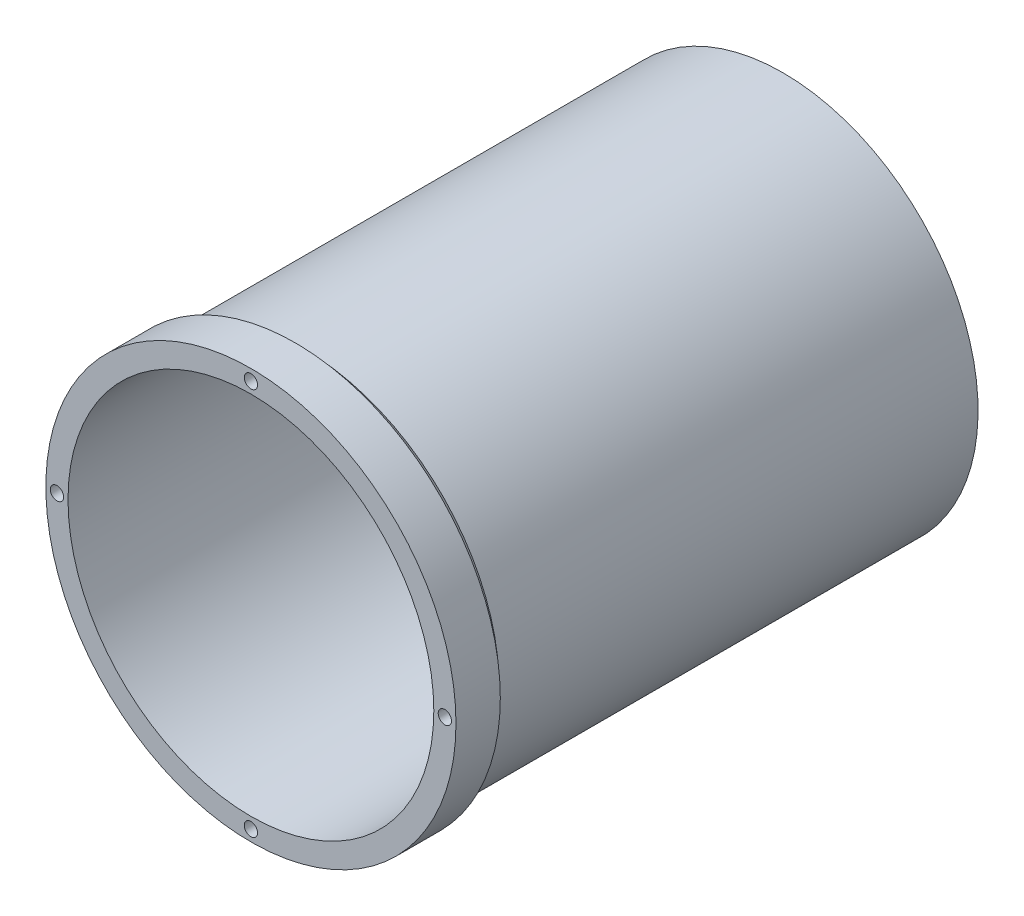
ISO-10303-21;
HEADER;
FILE_DESCRIPTION(('STEP AP214'),'2;1');
FILE_NAME('part.step','',(''),(''),'','','');
FILE_SCHEMA(('AUTOMOTIVE_DESIGN { 1 0 10303 214 1 1 1 1 }'));
ENDSEC;
DATA;
#1=APPLICATION_CONTEXT('core data for automotive mechanical design processes');
#2=APPLICATION_PROTOCOL_DEFINITION('international standard','automotive_design',2000,#1);
#3=PRODUCT_CONTEXT('',#1,'mechanical');
#4=PRODUCT('Part','Part','',(#3));
#5=PRODUCT_RELATED_PRODUCT_CATEGORY('part','',(#4));
#6=PRODUCT_DEFINITION_FORMATION('','',#4);
#7=PRODUCT_DEFINITION_CONTEXT('part definition',#1,'design');
#8=PRODUCT_DEFINITION('design','',#6,#7);
#9=PRODUCT_DEFINITION_SHAPE('','',#8);
#10=(LENGTH_UNIT() NAMED_UNIT(*) SI_UNIT(.MILLI.,.METRE.));
#11=(NAMED_UNIT(*) PLANE_ANGLE_UNIT() SI_UNIT($,.RADIAN.));
#12=(NAMED_UNIT(*) SI_UNIT($,.STERADIAN.) SOLID_ANGLE_UNIT());
#13=UNCERTAINTY_MEASURE_WITH_UNIT(LENGTH_MEASURE(1.E-05),#10,'distance_accuracy_value','');
#14=(GEOMETRIC_REPRESENTATION_CONTEXT(3) GLOBAL_UNCERTAINTY_ASSIGNED_CONTEXT((#13)) GLOBAL_UNIT_ASSIGNED_CONTEXT((#10,
#11,#12)) REPRESENTATION_CONTEXT('',''));
#15=CARTESIAN_POINT('',(0.,0.,0.));
#16=DIRECTION('',(0.,0.,1.));
#17=DIRECTION('',(1.,0.,0.));
#18=AXIS2_PLACEMENT_3D('',#15,#16,#17);
#19=CARTESIAN_POINT('',(0.,0.,0.));
#20=DIRECTION('',(0.,0.,1.));
#21=DIRECTION('',(1.,0.,0.));
#22=AXIS2_PLACEMENT_3D('',#19,#20,#21);
#23=PLANE('',#22);
#24=CARTESIAN_POINT('',(-55.5498,-1.93951090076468E-13,0.));
#25=DIRECTION('',(0.,0.,1.));
#26=DIRECTION('',(0.,1.,0.));
#27=AXIS2_PLACEMENT_3D('',#24,#25,#26);
#28=CIRCLE('',#27,1.905);
#29=CARTESIAN_POINT('',(-55.5498,1.90499999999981,0.));
#30=VERTEX_POINT('',#29);
#31=EDGE_CURVE('E222',#30,#30,#28,.T.);
#32=ORIENTED_EDGE('',*,*,#31,.F.);
#33=EDGE_LOOP('',(#32));
#34=FACE_BOUND('',#33,.T.);
#35=CARTESIAN_POINT('',(0.,-55.5498,0.));
#36=DIRECTION('',(0.,0.,1.));
#37=DIRECTION('',(-1.,0.,0.));
#38=AXIS2_PLACEMENT_3D('',#35,#36,#37);
#39=CIRCLE('',#38,1.905);
#40=CARTESIAN_POINT('',(-1.905,-55.5498,0.));
#41=VERTEX_POINT('',#40);
#42=EDGE_CURVE('E212',#41,#41,#39,.T.);
#43=ORIENTED_EDGE('',*,*,#42,.F.);
#44=EDGE_LOOP('',(#43));
#45=FACE_BOUND('',#44,.T.);
#46=CARTESIAN_POINT('',(55.5498,5.81853270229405E-13,0.));
#47=DIRECTION('',(0.,0.,1.));
#48=DIRECTION('',(0.,-1.,0.));
#49=AXIS2_PLACEMENT_3D('',#46,#47,#48);
#50=CIRCLE('',#49,1.905);
#51=CARTESIAN_POINT('',(55.5498,-1.90499999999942,0.));
#52=VERTEX_POINT('',#51);
#53=EDGE_CURVE('E208',#52,#52,#50,.T.);
#54=ORIENTED_EDGE('',*,*,#53,.F.);
#55=EDGE_LOOP('',(#54));
#56=FACE_BOUND('',#55,.T.);
#57=CARTESIAN_POINT('',(0.,55.5498,0.));
#58=DIRECTION('',(0.,0.,1.));
#59=DIRECTION('',(1.,0.,0.));
#60=AXIS2_PLACEMENT_3D('',#57,#58,#59);
#61=CIRCLE('',#60,1.905);
#62=CARTESIAN_POINT('',(1.905,55.5498,0.));
#63=VERTEX_POINT('',#62);
#64=EDGE_CURVE('E161',#63,#63,#61,.T.);
#65=ORIENTED_EDGE('',*,*,#64,.F.);
#66=EDGE_LOOP('',(#65));
#67=FACE_BOUND('',#66,.T.);
#68=CARTESIAN_POINT('',(0.,0.,0.));
#69=DIRECTION('',(0.,0.,1.));
#70=DIRECTION('',(1.,0.,0.));
#71=AXIS2_PLACEMENT_3D('',#68,#69,#70);
#72=CIRCLE('',#71,52.3875);
#73=CARTESIAN_POINT('',(52.3875,0.,0.));
#74=VERTEX_POINT('',#73);
#75=EDGE_CURVE('E92',#74,#74,#72,.T.);
#76=ORIENTED_EDGE('',*,*,#75,.F.);
#77=EDGE_LOOP('',(#76));
#78=FACE_BOUND('',#77,.T.);
#79=CARTESIAN_POINT('',(0.,0.,0.));
#80=DIRECTION('',(0.,0.,1.));
#81=DIRECTION('',(1.,0.,0.));
#82=AXIS2_PLACEMENT_3D('',#79,#80,#81);
#83=CIRCLE('',#82,58.7375);
#84=CARTESIAN_POINT('',(58.7375,0.,0.));
#85=VERTEX_POINT('',#84);
#86=EDGE_CURVE('E155',#85,#85,#83,.T.);
#87=ORIENTED_EDGE('',*,*,#86,.T.);
#88=EDGE_LOOP('',(#87));
#89=FACE_BOUND('',#88,.T.);
#90=ADVANCED_FACE('F38',(#34,#45,#56,#67,#78,#89),#23,.T.);
#91=CARTESIAN_POINT('',(0.,0.,-139.7));
#92=DIRECTION('',(0.,0.,1.));
#93=DIRECTION('',(1.,0.,0.));
#94=AXIS2_PLACEMENT_3D('',#91,#92,#93);
#95=CYLINDRICAL_SURFACE('',#94,52.3875);
#96=ORIENTED_EDGE('',*,*,#75,.T.);
#97=EDGE_LOOP('',(#96));
#98=FACE_BOUND('',#97,.T.);
#99=CARTESIAN_POINT('',(0.,0.,-139.7));
#100=DIRECTION('',(0.,0.,1.));
#101=DIRECTION('',(1.,0.,0.));
#102=AXIS2_PLACEMENT_3D('',#99,#100,#101);
#103=CIRCLE('',#102,52.3875);
#104=CARTESIAN_POINT('',(52.3875,0.,-139.7));
#105=VERTEX_POINT('',#104);
#106=EDGE_CURVE('E95',#105,#105,#103,.T.);
#107=ORIENTED_EDGE('',*,*,#106,.F.);
#108=EDGE_LOOP('',(#107));
#109=FACE_BOUND('',#108,.T.);
#110=ADVANCED_FACE('F119',(#98,#109),#95,.F.);
#111=CARTESIAN_POINT('',(0.,0.,-139.7));
#112=DIRECTION('',(0.,0.,1.));
#113=DIRECTION('',(1.,0.,0.));
#114=AXIS2_PLACEMENT_3D('',#111,#112,#113);
#115=PLANE('',#114);
#116=ORIENTED_EDGE('',*,*,#106,.T.);
#117=EDGE_LOOP('',(#116));
#118=FACE_BOUND('',#117,.T.);
#119=ADVANCED_FACE('F115',(#118),#115,.T.);
#120=CARTESIAN_POINT('',(0.,0.,-12.7));
#121=DIRECTION('',(0.,0.,1.));
#122=DIRECTION('',(1.,0.,0.));
#123=AXIS2_PLACEMENT_3D('',#120,#121,#122);
#124=CYLINDRICAL_SURFACE('',#123,58.7375);
#125=CARTESIAN_POINT('',(0.,0.,-12.7));
#126=DIRECTION('',(0.,0.,1.));
#127=DIRECTION('',(1.,0.,0.));
#128=AXIS2_PLACEMENT_3D('',#125,#126,#127);
#129=CIRCLE('',#128,58.7375);
#130=CARTESIAN_POINT('',(58.7375,0.,-12.7));
#131=VERTEX_POINT('',#130);
#132=EDGE_CURVE('E86',#131,#131,#129,.T.);
#133=ORIENTED_EDGE('',*,*,#132,.T.);
#134=EDGE_LOOP('',(#133));
#135=FACE_BOUND('',#134,.T.);
#136=ORIENTED_EDGE('',*,*,#86,.F.);
#137=EDGE_LOOP('',(#136));
#138=FACE_BOUND('',#137,.T.);
#139=ADVANCED_FACE('F113',(#135,#138),#124,.T.);
#140=CARTESIAN_POINT('',(0.,0.,-12.7));
#141=DIRECTION('',(0.,0.,1.));
#142=DIRECTION('',(1.,0.,0.));
#143=AXIS2_PLACEMENT_3D('',#140,#141,#142);
#144=PLANE('',#143);
#145=DIRECTION('',(-1.,0.,0.));
#146=VECTOR('',#145,1.);
#147=CARTESIAN_POINT('',(-1.57479999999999,-55.8578052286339,-12.7));
#148=LINE('',#147,#146);
#149=CARTESIAN_POINT('',(17.1114580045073,-55.8578052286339,-12.7));
#150=VERTEX_POINT('',#149);
#151=CARTESIAN_POINT('',(-17.1114580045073,-55.8578052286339,-12.7));
#152=VERTEX_POINT('',#151);
#153=EDGE_CURVE('E59',#150,#152,#148,.T.);
#154=ORIENTED_EDGE('',*,*,#153,.F.);
#155=CARTESIAN_POINT('',(0.,0.,-12.7));
#156=DIRECTION('',(0.,0.,1.));
#157=DIRECTION('',(1.,0.,0.));
#158=AXIS2_PLACEMENT_3D('',#155,#156,#157);
#159=CIRCLE('',#158,58.4200000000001);
#160=EDGE_CURVE('E104',#150,#152,#159,.T.);
#161=ORIENTED_EDGE('',*,*,#160,.T.);
#162=EDGE_LOOP('',(#154,#161));
#163=FACE_BOUND('',#162,.T.);
#164=ORIENTED_EDGE('',*,*,#132,.F.);
#165=EDGE_LOOP('',(#164));
#166=FACE_BOUND('',#165,.T.);
#167=ADVANCED_FACE('F126',(#163,#166),#144,.F.);
#168=CARTESIAN_POINT('',(0.,0.,-152.4));
#169=DIRECTION('',(0.,0.,1.));
#170=DIRECTION('',(1.,0.,0.));
#171=AXIS2_PLACEMENT_3D('',#168,#169,#170);
#172=PLANE('',#171);
#173=CARTESIAN_POINT('',(0.,0.,-152.4));
#174=DIRECTION('',(0.,0.,-1.));
#175=DIRECTION('',(-1.,0.,0.));
#176=AXIS2_PLACEMENT_3D('',#173,#174,#175);
#177=CIRCLE('',#176,2.667);
#178=CARTESIAN_POINT('',(-2.667,0.,-152.4));
#179=VERTEX_POINT('',#178);
#180=EDGE_CURVE('E215',#179,#179,#177,.T.);
#181=ORIENTED_EDGE('',*,*,#180,.F.);
#182=EDGE_LOOP('',(#181));
#183=FACE_BOUND('',#182,.T.);
#184=DIRECTION('',(1.,0.,0.));
#185=VECTOR('',#184,1.);
#186=CARTESIAN_POINT('',(0.,-55.8578052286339,-152.4));
#187=LINE('',#186,#185);
#188=CARTESIAN_POINT('',(-1.57479999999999,-55.8578052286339,-152.4));
#189=VERTEX_POINT('',#188);
#190=CARTESIAN_POINT('',(1.57479999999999,-55.8578052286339,-152.4));
#191=VERTEX_POINT('',#190);
#192=EDGE_CURVE('E78',#189,#191,#187,.T.);
#193=ORIENTED_EDGE('',*,*,#192,.F.);
#194=CARTESIAN_POINT('',(0.,0.,-152.4));
#195=DIRECTION('',(0.,0.,1.));
#196=DIRECTION('',(1.,0.,0.));
#197=AXIS2_PLACEMENT_3D('',#194,#195,#196);
#198=CIRCLE('',#197,55.88);
#199=EDGE_CURVE('E91',#191,#189,#198,.T.);
#200=ORIENTED_EDGE('',*,*,#199,.F.);
#201=EDGE_LOOP('',(#193,#200));
#202=FACE_BOUND('',#201,.T.);
#203=ADVANCED_FACE('F90',(#183,#202),#172,.F.);
#204=CARTESIAN_POINT('',(-1.57479999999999,-55.8578052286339,-464.949321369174));
#205=DIRECTION('',(0.,-1.,0.));
#206=DIRECTION('',(0.,0.,-1.));
#207=AXIS2_PLACEMENT_3D('',#204,#205,#206);
#208=PLANE('',#207);
#209=DIRECTION('',(0.,0.,1.));
#210=VECTOR('',#209,1.);
#211=CARTESIAN_POINT('',(1.57479999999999,-55.8578052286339,-464.949321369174));
#212=LINE('',#211,#210);
#213=CARTESIAN_POINT('',(1.57479999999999,-55.8578052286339,-15.2400000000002));
#214=VERTEX_POINT('',#213);
#215=EDGE_CURVE('E85',#191,#214,#212,.T.);
#216=ORIENTED_EDGE('',*,*,#215,.T.);
#217=CARTESIAN_POINT('',(1.57479999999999,-55.8578052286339,-15.2400000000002));
#218=CARTESIAN_POINT('',(2.23384813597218,-55.8578052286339,-15.2214602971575));
#219=CARTESIAN_POINT('',(2.89254994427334,-55.8578052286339,-15.191214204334));
#220=CARTESIAN_POINT('',(4.20845372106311,-55.8578052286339,-15.1077215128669));
#221=CARTESIAN_POINT('',(4.86565578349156,-55.8578052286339,-15.054476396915));
#222=CARTESIAN_POINT('',(6.17512121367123,-55.8578052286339,-14.9256626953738));
#223=CARTESIAN_POINT('',(6.82739376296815,-55.8578052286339,-14.8501874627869));
#224=CARTESIAN_POINT('',(8.12901794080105,-55.8578052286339,-14.6774712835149));
#225=CARTESIAN_POINT('',(8.77836955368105,-55.8578052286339,-14.5802302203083));
#226=CARTESIAN_POINT('',(10.7207220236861,-55.8578052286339,-14.2570067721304));
#227=CARTESIAN_POINT('',(12.0086294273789,-55.8578052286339,-13.9994630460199));
#228=CARTESIAN_POINT('',(13.9294913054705,-55.8578052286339,-13.5549584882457));
#229=CARTESIAN_POINT('',(14.5693102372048,-55.8578052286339,-13.3966884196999));
#230=CARTESIAN_POINT('',(15.844070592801,-55.8578052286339,-13.0618305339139));
#231=CARTESIAN_POINT('',(16.4790125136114,-55.8578052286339,-12.885244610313));
#232=CARTESIAN_POINT('',(17.1114580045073,-55.8578052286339,-12.7));
#233=B_SPLINE_CURVE_WITH_KNOTS('',3,(#217,#218,#219,#220,#221,#222,#223,#224,#225,#226,#227,
#228,#229,#230,#231,#232),.UNSPECIFIED.,.F.,.F.,(4,2,2,2,2,2,2,4),(0.,1.97779620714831,
3.95546492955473,5.92494425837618,7.89443413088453,11.8315814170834,13.8086823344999,
15.7855790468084),.UNSPECIFIED.);
#234=EDGE_CURVE('E53',#214,#150,#233,.T.);
#235=ORIENTED_EDGE('',*,*,#234,.T.);
#236=ORIENTED_EDGE('',*,*,#153,.T.);
#237=CARTESIAN_POINT('',(-17.1114580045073,-55.8578052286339,-12.7));
#238=CARTESIAN_POINT('',(-16.4790125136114,-55.8578052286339,-12.885244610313));
#239=CARTESIAN_POINT('',(-15.844070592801,-55.8578052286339,-13.0618305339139));
#240=CARTESIAN_POINT('',(-14.5693102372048,-55.8578052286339,-13.3966884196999));
#241=CARTESIAN_POINT('',(-13.9294913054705,-55.8578052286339,-13.5549584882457));
#242=CARTESIAN_POINT('',(-12.0086294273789,-55.8578052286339,-13.9994630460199));
#243=CARTESIAN_POINT('',(-10.7207220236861,-55.8578052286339,-14.2570067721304));
#244=CARTESIAN_POINT('',(-8.77836955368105,-55.8578052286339,-14.5802302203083));
#245=CARTESIAN_POINT('',(-8.12901794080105,-55.8578052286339,-14.6774712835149));
#246=CARTESIAN_POINT('',(-6.82739376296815,-55.8578052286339,-14.8501874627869));
#247=CARTESIAN_POINT('',(-6.17512121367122,-55.8578052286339,-14.9256626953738));
#248=CARTESIAN_POINT('',(-4.86565578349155,-55.8578052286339,-15.054476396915));
#249=CARTESIAN_POINT('',(-4.2084537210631,-55.8578052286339,-15.1077215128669));
#250=CARTESIAN_POINT('',(-2.89254994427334,-55.8578052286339,-15.191214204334));
#251=CARTESIAN_POINT('',(-2.23384813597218,-55.8578052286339,-15.2214602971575));
#252=CARTESIAN_POINT('',(-1.57479999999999,-55.8578052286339,-15.2400000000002));
#253=B_SPLINE_CURVE_WITH_KNOTS('',3,(#237,#238,#239,#240,#241,#242,#243,#244,#245,#246,#247,
#248,#249,#250,#251,#252),.UNSPECIFIED.,.F.,.F.,(4,2,2,2,2,2,2,4),(0.,1.97689671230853,
3.95399762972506,7.89114491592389,9.86063478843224,11.8301141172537,13.8077828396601,
15.7855790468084),.UNSPECIFIED.);
#254=CARTESIAN_POINT('',(-1.57479999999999,-55.8578052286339,-15.2400000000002));
#255=VERTEX_POINT('',#254);
#256=EDGE_CURVE('E11',#152,#255,#253,.T.);
#257=ORIENTED_EDGE('',*,*,#256,.T.);
#258=DIRECTION('',(0.,0.,1.));
#259=VECTOR('',#258,1.);
#260=CARTESIAN_POINT('',(-1.57479999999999,-55.8578052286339,-464.949321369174));
#261=LINE('',#260,#259);
#262=EDGE_CURVE('E74',#189,#255,#261,.T.);
#263=ORIENTED_EDGE('',*,*,#262,.F.);
#264=ORIENTED_EDGE('',*,*,#192,.T.);
#265=EDGE_LOOP('',(#216,#235,#236,#257,#263,#264));
#266=FACE_BOUND('',#265,.T.);
#267=ADVANCED_FACE('F77',(#266),#208,.T.);
#268=CARTESIAN_POINT('',(0.,0.,-152.4));
#269=DIRECTION('',(0.,0.,1.));
#270=DIRECTION('',(1.,0.,0.));
#271=AXIS2_PLACEMENT_3D('',#268,#269,#270);
#272=CYLINDRICAL_SURFACE('',#271,55.88);
#273=ORIENTED_EDGE('',*,*,#262,.T.);
#274=CARTESIAN_POINT('',(0.,0.,-15.2400000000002));
#275=DIRECTION('',(0.,0.,1.));
#276=DIRECTION('',(1.,0.,0.));
#277=AXIS2_PLACEMENT_3D('',#274,#275,#276);
#278=CIRCLE('',#277,55.88);
#279=EDGE_CURVE('E97',#255,#214,#278,.F.);
#280=ORIENTED_EDGE('',*,*,#279,.T.);
#281=ORIENTED_EDGE('',*,*,#215,.F.);
#282=ORIENTED_EDGE('',*,*,#199,.T.);
#283=EDGE_LOOP('',(#273,#280,#281,#282));
#284=FACE_BOUND('',#283,.T.);
#285=ADVANCED_FACE('F94',(#284),#272,.T.);
#286=CARTESIAN_POINT('',(0.,55.5498,-7.9248));
#287=DIRECTION('',(0.,0.,1.));
#288=DIRECTION('',(1.,0.,0.));
#289=AXIS2_PLACEMENT_3D('',#286,#287,#288);
#290=CYLINDRICAL_SURFACE('',#289,1.905);
#291=CARTESIAN_POINT('',(0.,55.5498,-7.9248));
#292=DIRECTION('',(0.,0.,1.));
#293=DIRECTION('',(1.,0.,0.));
#294=AXIS2_PLACEMENT_3D('',#291,#292,#293);
#295=CIRCLE('',#294,1.905);
#296=CARTESIAN_POINT('',(1.905,55.5498,-7.9248));
#297=VERTEX_POINT('',#296);
#298=EDGE_CURVE('E158',#297,#297,#295,.T.);
#299=ORIENTED_EDGE('',*,*,#298,.F.);
#300=EDGE_LOOP('',(#299));
#301=FACE_BOUND('',#300,.T.);
#302=ORIENTED_EDGE('',*,*,#64,.T.);
#303=EDGE_LOOP('',(#302));
#304=FACE_BOUND('',#303,.T.);
#305=ADVANCED_FACE('F131',(#301,#304),#290,.F.);
#306=CARTESIAN_POINT('',(0.,55.5498,-7.9248));
#307=DIRECTION('',(0.,0.,1.));
#308=DIRECTION('',(1.,0.,0.));
#309=AXIS2_PLACEMENT_3D('',#306,#307,#308);
#310=PLANE('',#309);
#311=ORIENTED_EDGE('',*,*,#298,.T.);
#312=EDGE_LOOP('',(#311));
#313=FACE_BOUND('',#312,.T.);
#314=ADVANCED_FACE('F135',(#313),#310,.T.);
#315=CARTESIAN_POINT('',(55.5498,5.81853270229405E-13,-7.9248));
#316=DIRECTION('',(0.,0.,1.));
#317=DIRECTION('',(1.,0.,0.));
#318=AXIS2_PLACEMENT_3D('',#315,#316,#317);
#319=CYLINDRICAL_SURFACE('',#318,1.905);
#320=CARTESIAN_POINT('',(55.5498,5.81853270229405E-13,-7.9248));
#321=DIRECTION('',(0.,0.,1.));
#322=DIRECTION('',(0.,-1.,0.));
#323=AXIS2_PLACEMENT_3D('',#320,#321,#322);
#324=CIRCLE('',#323,1.905);
#325=CARTESIAN_POINT('',(55.5498,-1.90499999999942,-7.9248));
#326=VERTEX_POINT('',#325);
#327=EDGE_CURVE('E205',#326,#326,#324,.T.);
#328=ORIENTED_EDGE('',*,*,#327,.F.);
#329=EDGE_LOOP('',(#328));
#330=FACE_BOUND('',#329,.T.);
#331=ORIENTED_EDGE('',*,*,#53,.T.);
#332=EDGE_LOOP('',(#331));
#333=FACE_BOUND('',#332,.T.);
#334=ADVANCED_FACE('F141',(#330,#333),#319,.F.);
#335=CARTESIAN_POINT('',(55.5498,5.81853270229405E-13,-7.9248));
#336=DIRECTION('',(0.,0.,1.));
#337=DIRECTION('',(0.,-1.,0.));
#338=AXIS2_PLACEMENT_3D('',#335,#336,#337);
#339=PLANE('',#338);
#340=ORIENTED_EDGE('',*,*,#327,.T.);
#341=EDGE_LOOP('',(#340));
#342=FACE_BOUND('',#341,.T.);
#343=ADVANCED_FACE('F194',(#342),#339,.T.);
#344=CARTESIAN_POINT('',(0.,-55.5498,-7.9248));
#345=DIRECTION('',(0.,0.,1.));
#346=DIRECTION('',(1.,0.,0.));
#347=AXIS2_PLACEMENT_3D('',#344,#345,#346);
#348=CYLINDRICAL_SURFACE('',#347,1.905);
#349=CARTESIAN_POINT('',(0.,-55.5498,-7.9248));
#350=DIRECTION('',(0.,0.,1.));
#351=DIRECTION('',(-1.,0.,0.));
#352=AXIS2_PLACEMENT_3D('',#349,#350,#351);
#353=CIRCLE('',#352,1.905);
#354=CARTESIAN_POINT('',(-1.905,-55.5498,-7.9248));
#355=VERTEX_POINT('',#354);
#356=EDGE_CURVE('E226',#355,#355,#353,.T.);
#357=ORIENTED_EDGE('',*,*,#356,.F.);
#358=EDGE_LOOP('',(#357));
#359=FACE_BOUND('',#358,.T.);
#360=ORIENTED_EDGE('',*,*,#42,.T.);
#361=EDGE_LOOP('',(#360));
#362=FACE_BOUND('',#361,.T.);
#363=ADVANCED_FACE('F190',(#359,#362),#348,.F.);
#364=CARTESIAN_POINT('',(0.,-55.5498,-7.9248));
#365=DIRECTION('',(0.,0.,1.));
#366=DIRECTION('',(-1.,0.,0.));
#367=AXIS2_PLACEMENT_3D('',#364,#365,#366);
#368=PLANE('',#367);
#369=ORIENTED_EDGE('',*,*,#356,.T.);
#370=EDGE_LOOP('',(#369));
#371=FACE_BOUND('',#370,.T.);
#372=ADVANCED_FACE('F182',(#371),#368,.T.);
#373=CARTESIAN_POINT('',(-55.5498,-1.93951090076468E-13,-7.9248));
#374=DIRECTION('',(0.,0.,1.));
#375=DIRECTION('',(1.,0.,0.));
#376=AXIS2_PLACEMENT_3D('',#373,#374,#375);
#377=CYLINDRICAL_SURFACE('',#376,1.905);
#378=CARTESIAN_POINT('',(-55.5498,-1.93951090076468E-13,-7.9248));
#379=DIRECTION('',(0.,0.,1.));
#380=DIRECTION('',(0.,1.,0.));
#381=AXIS2_PLACEMENT_3D('',#378,#379,#380);
#382=CIRCLE('',#381,1.905);
#383=CARTESIAN_POINT('',(-55.5498,1.90499999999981,-7.9248));
#384=VERTEX_POINT('',#383);
#385=EDGE_CURVE('E220',#384,#384,#382,.T.);
#386=ORIENTED_EDGE('',*,*,#385,.F.);
#387=EDGE_LOOP('',(#386));
#388=FACE_BOUND('',#387,.T.);
#389=ORIENTED_EDGE('',*,*,#31,.T.);
#390=EDGE_LOOP('',(#389));
#391=FACE_BOUND('',#390,.T.);
#392=ADVANCED_FACE('F176',(#388,#391),#377,.F.);
#393=CARTESIAN_POINT('',(-55.5498,-1.93951090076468E-13,-7.9248));
#394=DIRECTION('',(0.,0.,1.));
#395=DIRECTION('',(0.,1.,0.));
#396=AXIS2_PLACEMENT_3D('',#393,#394,#395);
#397=PLANE('',#396);
#398=ORIENTED_EDGE('',*,*,#385,.T.);
#399=EDGE_LOOP('',(#398));
#400=FACE_BOUND('',#399,.T.);
#401=ADVANCED_FACE('F168',(#400),#397,.T.);
#402=CARTESIAN_POINT('',(0.,0.,-15.2400000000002));
#403=DIRECTION('',(0.,0.,1.));
#404=DIRECTION('',(1.,0.,0.));
#405=AXIS2_PLACEMENT_3D('',#402,#403,#404);
#406=CONICAL_SURFACE('',#405,55.88,0.785398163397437);
#407=ORIENTED_EDGE('',*,*,#256,.F.);
#408=ORIENTED_EDGE('',*,*,#160,.F.);
#409=ORIENTED_EDGE('',*,*,#234,.F.);
#410=ORIENTED_EDGE('',*,*,#279,.F.);
#411=EDGE_LOOP('',(#407,#408,#409,#410));
#412=FACE_BOUND('',#411,.T.);
#413=ADVANCED_FACE('F41',(#412),#406,.T.);
#414=CARTESIAN_POINT('',(0.,0.,-142.875));
#415=DIRECTION('',(0.,0.,-1.));
#416=DIRECTION('',(-1.,0.,0.));
#417=AXIS2_PLACEMENT_3D('',#414,#415,#416);
#418=CYLINDRICAL_SURFACE('',#417,2.667);
#419=CARTESIAN_POINT('',(0.,0.,-142.875));
#420=DIRECTION('',(0.,0.,-1.));
#421=DIRECTION('',(-1.,0.,0.));
#422=AXIS2_PLACEMENT_3D('',#419,#420,#421);
#423=CIRCLE('',#422,2.667);
#424=CARTESIAN_POINT('',(-2.667,0.,-142.875));
#425=VERTEX_POINT('',#424);
#426=EDGE_CURVE('E210',#425,#425,#423,.T.);
#427=CARTESIAN_POINT('',(-2.667,0.,-142.875));
#428=CARTESIAN_POINT('',(-2.667,0.,-142.97421875));
#429=CARTESIAN_POINT('',(-2.667,0.,-143.0734375));
#430=CARTESIAN_POINT('',(-2.667,0.,-143.271875));
#431=CARTESIAN_POINT('',(-2.667,0.,-143.37109375));
#432=CARTESIAN_POINT('',(-2.667,0.,-143.56953125));
#433=CARTESIAN_POINT('',(-2.667,0.,-143.66875));
#434=CARTESIAN_POINT('',(-2.667,0.,-143.8671875));
#435=CARTESIAN_POINT('',(-2.667,0.,-143.96640625));
#436=CARTESIAN_POINT('',(-2.667,0.,-144.16484375));
#437=CARTESIAN_POINT('',(-2.667,0.,-144.2640625));
#438=CARTESIAN_POINT('',(-2.667,0.,-144.4625));
#439=CARTESIAN_POINT('',(-2.667,0.,-144.56171875));
#440=CARTESIAN_POINT('',(-2.667,0.,-144.76015625));
#441=CARTESIAN_POINT('',(-2.667,0.,-144.859375));
#442=CARTESIAN_POINT('',(-2.667,0.,-145.0578125));
#443=CARTESIAN_POINT('',(-2.667,0.,-145.15703125));
#444=CARTESIAN_POINT('',(-2.667,0.,-145.35546875));
#445=CARTESIAN_POINT('',(-2.667,0.,-145.4546875));
#446=CARTESIAN_POINT('',(-2.667,0.,-145.653125));
#447=CARTESIAN_POINT('',(-2.667,0.,-145.75234375));
#448=CARTESIAN_POINT('',(-2.667,0.,-145.95078125));
#449=CARTESIAN_POINT('',(-2.667,0.,-146.05));
#450=CARTESIAN_POINT('',(-2.667,0.,-146.2484375));
#451=CARTESIAN_POINT('',(-2.667,0.,-146.34765625));
#452=CARTESIAN_POINT('',(-2.667,0.,-146.54609375));
#453=CARTESIAN_POINT('',(-2.667,0.,-146.6453125));
#454=CARTESIAN_POINT('',(-2.667,0.,-146.84375));
#455=CARTESIAN_POINT('',(-2.667,0.,-146.94296875));
#456=CARTESIAN_POINT('',(-2.667,0.,-147.14140625));
#457=CARTESIAN_POINT('',(-2.667,0.,-147.240625));
#458=CARTESIAN_POINT('',(-2.667,0.,-147.4390625));
#459=CARTESIAN_POINT('',(-2.667,0.,-147.53828125));
#460=CARTESIAN_POINT('',(-2.667,0.,-147.73671875));
#461=CARTESIAN_POINT('',(-2.667,0.,-147.8359375));
#462=CARTESIAN_POINT('',(-2.667,0.,-148.034375));
#463=CARTESIAN_POINT('',(-2.667,0.,-148.13359375));
#464=CARTESIAN_POINT('',(-2.667,0.,-148.33203125));
#465=CARTESIAN_POINT('',(-2.667,0.,-148.43125));
#466=CARTESIAN_POINT('',(-2.667,0.,-148.6296875));
#467=CARTESIAN_POINT('',(-2.667,0.,-148.72890625));
#468=CARTESIAN_POINT('',(-2.667,0.,-148.92734375));
#469=CARTESIAN_POINT('',(-2.667,0.,-149.0265625));
#470=CARTESIAN_POINT('',(-2.667,0.,-149.225));
#471=CARTESIAN_POINT('',(-2.667,0.,-149.32421875));
#472=CARTESIAN_POINT('',(-2.667,0.,-149.52265625));
#473=CARTESIAN_POINT('',(-2.667,0.,-149.621875));
#474=CARTESIAN_POINT('',(-2.667,0.,-149.8203125));
#475=CARTESIAN_POINT('',(-2.667,0.,-149.91953125));
#476=CARTESIAN_POINT('',(-2.667,0.,-150.11796875));
#477=CARTESIAN_POINT('',(-2.667,0.,-150.2171875));
#478=CARTESIAN_POINT('',(-2.667,0.,-150.415625));
#479=CARTESIAN_POINT('',(-2.667,0.,-150.51484375));
#480=CARTESIAN_POINT('',(-2.667,0.,-150.71328125));
#481=CARTESIAN_POINT('',(-2.667,0.,-150.8125));
#482=CARTESIAN_POINT('',(-2.667,0.,-151.0109375));
#483=CARTESIAN_POINT('',(-2.667,0.,-151.11015625));
#484=CARTESIAN_POINT('',(-2.667,0.,-151.30859375));
#485=CARTESIAN_POINT('',(-2.667,0.,-151.4078125));
#486=CARTESIAN_POINT('',(-2.667,0.,-151.60625));
#487=CARTESIAN_POINT('',(-2.667,0.,-151.70546875));
#488=CARTESIAN_POINT('',(-2.667,0.,-151.90390625));
#489=CARTESIAN_POINT('',(-2.667,0.,-152.003125));
#490=CARTESIAN_POINT('',(-2.667,0.,-152.2015625));
#491=CARTESIAN_POINT('',(-2.667,0.,-152.30078125));
#492=CARTESIAN_POINT('',(-2.667,0.,-152.4));
#493=B_SPLINE_CURVE_WITH_KNOTS('',3,(#427,#428,#429,#430,#431,#432,#433,#434,#435,#436,#437,
#438,#439,#440,#441,#442,#443,#444,#445,#446,#447,#448,#449,#450,#451,#452,#453,#454,#455,#456,
#457,#458,#459,#460,#461,#462,#463,#464,#465,#466,#467,#468,#469,#470,#471,#472,#473,#474,#475,
#476,#477,#478,#479,#480,#481,#482,#483,#484,#485,#486,#487,#488,#489,#490,#491,#492),
.UNSPECIFIED.,.F.,.F.,(4,2,2,2,2,2,2,2,2,2,2,2,2,2,2,2,2,2,2,2,2,2,2,2,2,2,2,2,2,2,2,2,4),(0.,
0.29765625,0.5953125,0.892968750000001,1.190625,1.48828125,1.7859375,2.08359375,2.38125,
2.67890625,2.9765625,3.27421875,3.571875,3.86953125,4.1671875,4.46484375,4.7625,5.06015625,
5.3578125,5.65546875,5.953125,6.25078125,6.5484375,6.84609375,7.14375,7.44140625,7.7390625,
8.03671875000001,8.334375,8.63203125,8.92968750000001,9.22734375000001,9.52500000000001),.UNSPECIFIED.);
#494=EDGE_CURVE('BSEAM167',#425,#179,#493,.T.);
#495=ORIENTED_EDGE('',*,*,#426,.F.);
#496=ORIENTED_EDGE('',*,*,#180,.T.);
#497=ORIENTED_EDGE('',*,*,#494,.T.);
#498=ORIENTED_EDGE('',*,*,#494,.F.);
#499=EDGE_LOOP('',(#495,#497,#496,#498));
#500=FACE_BOUND('',#499,.T.);
#501=ADVANCED_FACE('F167',(#500),#418,.F.);
#502=CARTESIAN_POINT('',(0.,0.,-142.875));
#503=DIRECTION('',(0.,0.,-1.));
#504=DIRECTION('',(-1.,0.,0.));
#505=AXIS2_PLACEMENT_3D('',#502,#503,#504);
#506=PLANE('',#505);
#507=ORIENTED_EDGE('',*,*,#426,.T.);
#508=EDGE_LOOP('',(#507));
#509=FACE_BOUND('',#508,.T.);
#510=ADVANCED_FACE('F173',(#509),#506,.T.);
#511=CLOSED_SHELL('',(#90,#110,#119,#139,#167,#203,#267,#285,#305,#314,#334,#343,#363,#372,#392,
#401,#413,#501,#510));
#512=MANIFOLD_SOLID_BREP('B2',#511);
#513=ADVANCED_BREP_SHAPE_REPRESENTATION('',(#18,#512),#14);
#514=SHAPE_DEFINITION_REPRESENTATION(#9,#513);
ENDSEC;
END-ISO-10303-21;
